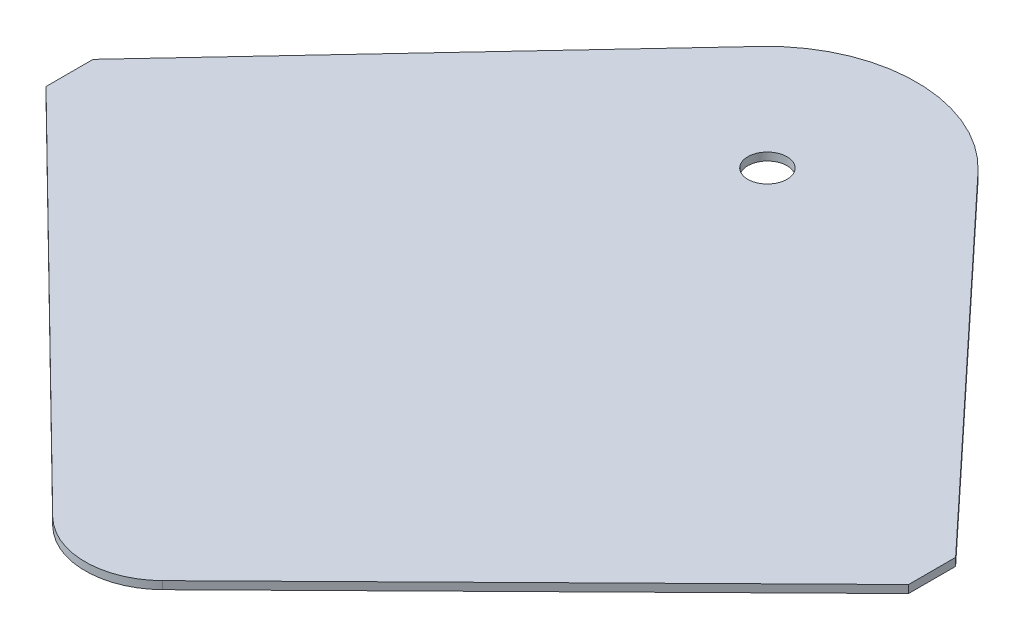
from build123d import *

# Parameters (mm, degrees)
SKETCH1_R      = 2.5
EXTRUDE1_DEPTH = 1


with BuildPart() as part:
    # Sketch1 → Extrude1 (new body)
    with BuildSketch(Plane(origin=(0, 0, 0), x_dir=(1, 0, 0), z_dir=(0, 1, 0))):
        with BuildLine():
            Line((55, 46), (55, 40))
            Line((55, 40), (7.006972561, -7.134587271))
            ThreePointArc((7.006972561, -7.134587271), (0, -10), (-7.006972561, -7.134587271))
            Line((-7.006972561, -7.134587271), (-55, 40))
            Line((-55, 40), (-55, 46))
            Line((-55, 46), (-13.877946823, 89.977002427))
            ThreePointArc((-13.877946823, 89.977002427), (0, 96), (13.877946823, 89.977002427))
            Line((13.877946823, 89.977002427), (55, 46))
        make_face()
        with Locations(Location((0, 77, 0), (0, 0, 270))):
            Circle(SKETCH1_R, mode=Mode.SUBTRACT)
    extrude(amount=EXTRUDE1_DEPTH)


solid = part.part
